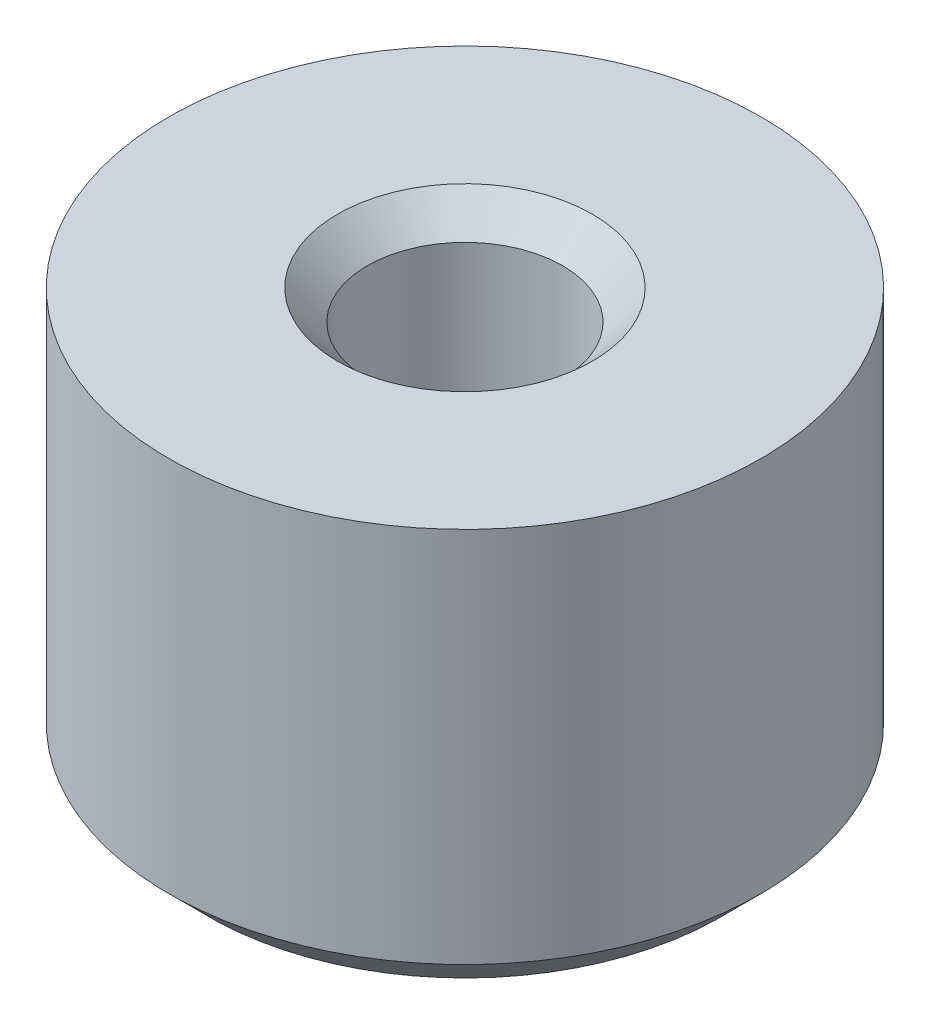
ISO-10303-21;
HEADER;
FILE_DESCRIPTION(('STEP AP214'),'2;1');
FILE_NAME('part.step','',(''),(''),'','','');
FILE_SCHEMA(('AUTOMOTIVE_DESIGN { 1 0 10303 214 1 1 1 1 }'));
ENDSEC;
DATA;
#1=APPLICATION_CONTEXT('core data for automotive mechanical design processes');
#2=APPLICATION_PROTOCOL_DEFINITION('international standard','automotive_design',2000,#1);
#3=PRODUCT_CONTEXT('',#1,'mechanical');
#4=PRODUCT('Part','Part','',(#3));
#5=PRODUCT_RELATED_PRODUCT_CATEGORY('part','',(#4));
#6=PRODUCT_DEFINITION_FORMATION('','',#4);
#7=PRODUCT_DEFINITION_CONTEXT('part definition',#1,'design');
#8=PRODUCT_DEFINITION('design','',#6,#7);
#9=PRODUCT_DEFINITION_SHAPE('','',#8);
#10=(LENGTH_UNIT() NAMED_UNIT(*) SI_UNIT(.MILLI.,.METRE.));
#11=(NAMED_UNIT(*) PLANE_ANGLE_UNIT() SI_UNIT($,.RADIAN.));
#12=(NAMED_UNIT(*) SI_UNIT($,.STERADIAN.) SOLID_ANGLE_UNIT());
#13=UNCERTAINTY_MEASURE_WITH_UNIT(LENGTH_MEASURE(1.E-05),#10,'distance_accuracy_value','');
#14=(GEOMETRIC_REPRESENTATION_CONTEXT(3) GLOBAL_UNCERTAINTY_ASSIGNED_CONTEXT((#13)) GLOBAL_UNIT_ASSIGNED_CONTEXT((#10,
#11,#12)) REPRESENTATION_CONTEXT('',''));
#15=CARTESIAN_POINT('',(0.,0.,0.));
#16=DIRECTION('',(0.,0.,1.));
#17=DIRECTION('',(1.,0.,0.));
#18=AXIS2_PLACEMENT_3D('',#15,#16,#17);
#19=CARTESIAN_POINT('',(0.,0.,0.));
#20=DIRECTION('',(0.,-1.,0.));
#21=DIRECTION('',(0.,0.,-1.));
#22=AXIS2_PLACEMENT_3D('',#19,#20,#21);
#23=CYLINDRICAL_SURFACE('',#22,14.925);
#24=CARTESIAN_POINT('',(0.,7.,0.));
#25=DIRECTION('',(0.,-1.,0.));
#26=DIRECTION('',(0.,0.,-1.));
#27=AXIS2_PLACEMENT_3D('',#24,#25,#26);
#28=CIRCLE('',#27,14.925);
#29=CARTESIAN_POINT('',(0.,7.,-14.925));
#30=VERTEX_POINT('',#29);
#31=EDGE_CURVE('E37',#30,#30,#28,.T.);
#32=ORIENTED_EDGE('',*,*,#31,.F.);
#33=EDGE_LOOP('',(#32));
#34=FACE_BOUND('',#33,.T.);
#35=CARTESIAN_POINT('',(0.,26.,0.));
#36=DIRECTION('',(0.,-1.,0.));
#37=DIRECTION('',(0.,0.,-1.));
#38=AXIS2_PLACEMENT_3D('',#35,#36,#37);
#39=CIRCLE('',#38,14.925);
#40=CARTESIAN_POINT('',(0.,26.,-14.925));
#41=VERTEX_POINT('',#40);
#42=EDGE_CURVE('E10',#41,#41,#39,.T.);
#43=ORIENTED_EDGE('',*,*,#42,.T.);
#44=EDGE_LOOP('',(#43));
#45=FACE_BOUND('',#44,.T.);
#46=ADVANCED_FACE('F31',(#34,#45),#23,.T.);
#47=CARTESIAN_POINT('',(0.,7.,0.));
#48=DIRECTION('',(0.,1.,0.));
#49=DIRECTION('',(0.,0.,1.));
#50=AXIS2_PLACEMENT_3D('',#47,#48,#49);
#51=CONICAL_SURFACE('',#50,14.925,0.785398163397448);
#52=CARTESIAN_POINT('',(0.,5.,0.));
#53=DIRECTION('',(0.,-1.,0.));
#54=DIRECTION('',(0.,0.,-1.));
#55=AXIS2_PLACEMENT_3D('',#52,#53,#54);
#56=CIRCLE('',#55,12.925);
#57=CARTESIAN_POINT('',(0.,5.,-12.925));
#58=VERTEX_POINT('',#57);
#59=EDGE_CURVE('E41',#58,#58,#56,.T.);
#60=ORIENTED_EDGE('',*,*,#59,.F.);
#61=EDGE_LOOP('',(#60));
#62=FACE_BOUND('',#61,.T.);
#63=ORIENTED_EDGE('',*,*,#31,.T.);
#64=EDGE_LOOP('',(#63));
#65=FACE_BOUND('',#64,.T.);
#66=ADVANCED_FACE('F101',(#62,#65),#51,.T.);
#67=CARTESIAN_POINT('',(-7.5,5.,0.));
#68=DIRECTION('',(0.,1.,0.));
#69=DIRECTION('',(0.,0.,1.));
#70=AXIS2_PLACEMENT_3D('',#67,#68,#69);
#71=PLANE('',#70);
#72=CARTESIAN_POINT('',(0.,5.,0.));
#73=DIRECTION('',(0.,-1.,0.));
#74=DIRECTION('',(0.,0.,-1.));
#75=AXIS2_PLACEMENT_3D('',#72,#73,#74);
#76=CIRCLE('',#75,1.5);
#77=CARTESIAN_POINT('',(0.,5.,-1.5));
#78=VERTEX_POINT('',#77);
#79=EDGE_CURVE('E45',#78,#78,#76,.T.);
#80=ORIENTED_EDGE('',*,*,#79,.F.);
#81=EDGE_LOOP('',(#80));
#82=FACE_BOUND('',#81,.T.);
#83=ORIENTED_EDGE('',*,*,#59,.T.);
#84=EDGE_LOOP('',(#83));
#85=FACE_BOUND('',#84,.T.);
#86=ADVANCED_FACE('F95',(#82,#85),#71,.F.);
#87=CARTESIAN_POINT('',(0.,0.,0.));
#88=DIRECTION('',(0.,-1.,0.));
#89=DIRECTION('',(0.,0.,-1.));
#90=AXIS2_PLACEMENT_3D('',#87,#88,#89);
#91=CYLINDRICAL_SURFACE('',#90,1.5);
#92=CARTESIAN_POINT('',(0.,8.,0.));
#93=DIRECTION('',(0.,-1.,0.));
#94=DIRECTION('',(0.,0.,-1.));
#95=AXIS2_PLACEMENT_3D('',#92,#93,#94);
#96=CIRCLE('',#95,1.5);
#97=CARTESIAN_POINT('',(0.,8.,-1.5));
#98=VERTEX_POINT('',#97);
#99=EDGE_CURVE('E50',#98,#98,#96,.T.);
#100=ORIENTED_EDGE('',*,*,#99,.F.);
#101=EDGE_LOOP('',(#100));
#102=FACE_BOUND('',#101,.T.);
#103=ORIENTED_EDGE('',*,*,#79,.T.);
#104=EDGE_LOOP('',(#103));
#105=FACE_BOUND('',#104,.T.);
#106=ADVANCED_FACE('F89',(#102,#105),#91,.F.);
#107=CARTESIAN_POINT('',(-1.925,8.,0.));
#108=DIRECTION('',(0.,-1.,0.));
#109=DIRECTION('',(0.,0.,-1.));
#110=AXIS2_PLACEMENT_3D('',#107,#108,#109);
#111=PLANE('',#110);
#112=CARTESIAN_POINT('',(0.,8.,0.));
#113=DIRECTION('',(0.,-1.,0.));
#114=DIRECTION('',(0.,0.,-1.));
#115=AXIS2_PLACEMENT_3D('',#112,#113,#114);
#116=CIRCLE('',#115,1.925);
#117=CARTESIAN_POINT('',(0.,8.,-1.925));
#118=VERTEX_POINT('',#117);
#119=EDGE_CURVE('E53',#118,#118,#116,.T.);
#120=ORIENTED_EDGE('',*,*,#119,.F.);
#121=EDGE_LOOP('',(#120));
#122=FACE_BOUND('',#121,.T.);
#123=ORIENTED_EDGE('',*,*,#99,.T.);
#124=EDGE_LOOP('',(#123));
#125=FACE_BOUND('',#124,.T.);
#126=ADVANCED_FACE('F83',(#122,#125),#111,.F.);
#127=CARTESIAN_POINT('',(0.,11.,0.));
#128=DIRECTION('',(0.,-1.,0.));
#129=DIRECTION('',(0.,0.,-1.));
#130=AXIS2_PLACEMENT_3D('',#127,#128,#129);
#131=DEGENERATE_TOROIDAL_SURFACE('',#130,1.925,3.,.T.);
#132=CARTESIAN_POINT('',(0.,11.,0.));
#133=DIRECTION('',(0.,-1.,0.));
#134=DIRECTION('',(0.,0.,-1.));
#135=AXIS2_PLACEMENT_3D('',#132,#133,#134);
#136=CIRCLE('',#135,4.925);
#137=CARTESIAN_POINT('',(0.,11.,-4.925));
#138=VERTEX_POINT('',#137);
#139=EDGE_CURVE('E56',#138,#138,#136,.T.);
#140=ORIENTED_EDGE('',*,*,#139,.F.);
#141=EDGE_LOOP('',(#140));
#142=FACE_BOUND('',#141,.T.);
#143=ORIENTED_EDGE('',*,*,#119,.T.);
#144=EDGE_LOOP('',(#143));
#145=FACE_BOUND('',#144,.T.);
#146=ADVANCED_FACE('F77',(#142,#145),#131,.F.);
#147=CARTESIAN_POINT('',(0.,0.,0.));
#148=DIRECTION('',(0.,-1.,0.));
#149=DIRECTION('',(0.,0.,-1.));
#150=AXIS2_PLACEMENT_3D('',#147,#148,#149);
#151=CYLINDRICAL_SURFACE('',#150,4.925);
#152=CARTESIAN_POINT('',(0.,24.5,0.));
#153=DIRECTION('',(0.,-1.,0.));
#154=DIRECTION('',(0.,0.,-1.));
#155=AXIS2_PLACEMENT_3D('',#152,#153,#154);
#156=CIRCLE('',#155,4.925);
#157=CARTESIAN_POINT('',(0.,24.5,-4.925));
#158=VERTEX_POINT('',#157);
#159=EDGE_CURVE('E59',#158,#158,#156,.T.);
#160=ORIENTED_EDGE('',*,*,#159,.F.);
#161=EDGE_LOOP('',(#160));
#162=FACE_BOUND('',#161,.T.);
#163=ORIENTED_EDGE('',*,*,#139,.T.);
#164=EDGE_LOOP('',(#163));
#165=FACE_BOUND('',#164,.T.);
#166=ADVANCED_FACE('F71',(#162,#165),#151,.F.);
#167=CARTESIAN_POINT('',(0.,24.5,0.));
#168=DIRECTION('',(0.,1.,0.));
#169=DIRECTION('',(0.,0.,1.));
#170=AXIS2_PLACEMENT_3D('',#167,#168,#169);
#171=CONICAL_SURFACE('',#170,4.925,0.785398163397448);
#172=CARTESIAN_POINT('',(0.,26.,0.));
#173=DIRECTION('',(0.,-1.,0.));
#174=DIRECTION('',(0.,0.,-1.));
#175=AXIS2_PLACEMENT_3D('',#172,#173,#174);
#176=CIRCLE('',#175,6.425);
#177=CARTESIAN_POINT('',(0.,26.,-6.425));
#178=VERTEX_POINT('',#177);
#179=EDGE_CURVE('E62',#178,#178,#176,.T.);
#180=ORIENTED_EDGE('',*,*,#179,.F.);
#181=EDGE_LOOP('',(#180));
#182=FACE_BOUND('',#181,.T.);
#183=ORIENTED_EDGE('',*,*,#159,.T.);
#184=EDGE_LOOP('',(#183));
#185=FACE_BOUND('',#184,.T.);
#186=ADVANCED_FACE('F68',(#182,#185),#171,.F.);
#187=CARTESIAN_POINT('',(-7.89507676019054,26.,0.));
#188=DIRECTION('',(0.,-1.,0.));
#189=DIRECTION('',(0.,0.,-1.));
#190=AXIS2_PLACEMENT_3D('',#187,#188,#189);
#191=PLANE('',#190);
#192=ORIENTED_EDGE('',*,*,#42,.F.);
#193=EDGE_LOOP('',(#192));
#194=FACE_BOUND('',#193,.T.);
#195=ORIENTED_EDGE('',*,*,#179,.T.);
#196=EDGE_LOOP('',(#195));
#197=FACE_BOUND('',#196,.T.);
#198=ADVANCED_FACE('F66',(#194,#197),#191,.F.);
#199=CLOSED_SHELL('',(#46,#66,#86,#106,#126,#146,#166,#186,#198));
#200=MANIFOLD_SOLID_BREP('B2',#199);
#201=ADVANCED_BREP_SHAPE_REPRESENTATION('',(#18,#200),#14);
#202=SHAPE_DEFINITION_REPRESENTATION(#9,#201);
ENDSEC;
END-ISO-10303-21;
